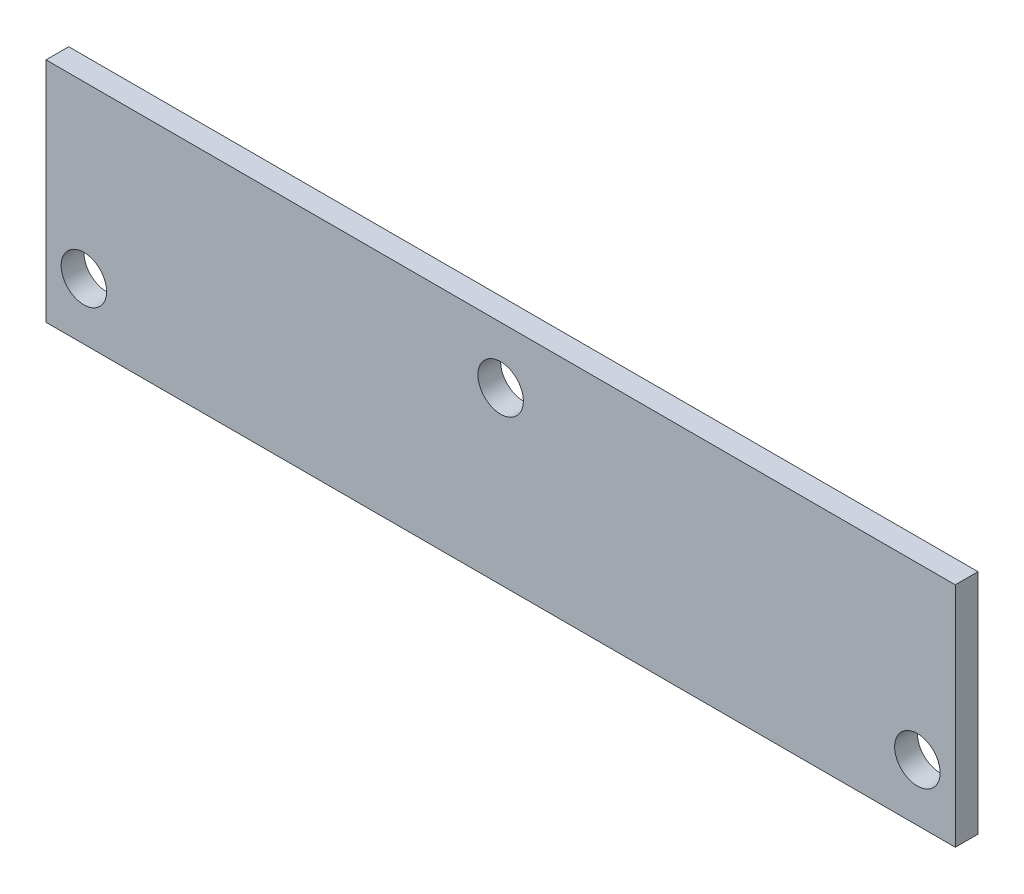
from build123d import *

# Parameters (mm, degrees)
CROQUIS1_W              = 120
CROQUIS1_H              = 30
SALIENTE_EXTRUIR1_DEPTH = 3
CROQUIS2_R              = 3
CORTAR_EXTRUIR1_DEPTH   = 6


with BuildPart() as part:
    # Croquis1 → Saliente-Extruir1 (new body)
    with BuildSketch(Plane.XY):
        with Locations((60, 15)):
            Rectangle(CROQUIS1_W, CROQUIS1_H)
    extrude(amount=SALIENTE_EXTRUIR1_DEPTH)

    # Croquis2 → Cortar-Extruir1 (cut)
    with BuildSketch(Plane.XY.offset(3)):
        with Locations((60, 22.5)):
            Circle(CROQUIS2_R)
        with Locations((115, 7.5)):
            Circle(CROQUIS2_R)
        with Locations(Location((5, 7.5, 0), (0, 0, 180))):
            Circle(CROQUIS2_R)
    extrude(amount=-CORTAR_EXTRUIR1_DEPTH, mode=Mode.SUBTRACT)


solid = part.part
